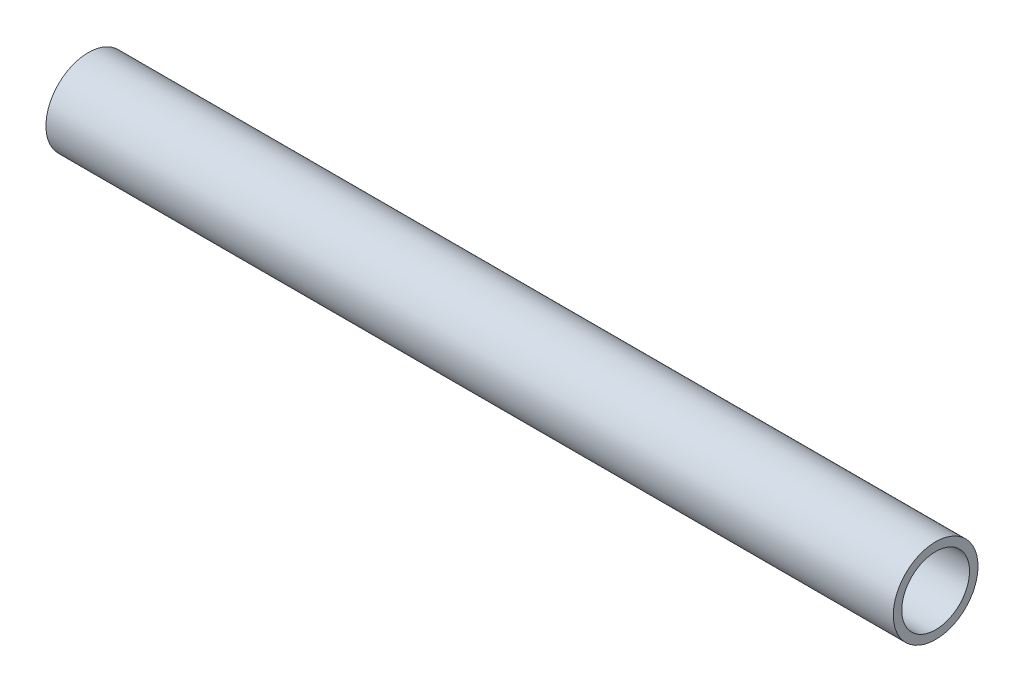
ISO-10303-21;
HEADER;
FILE_DESCRIPTION(('STEP AP214'),'2;1');
FILE_NAME('part.step','',(''),(''),'','','');
FILE_SCHEMA(('AUTOMOTIVE_DESIGN { 1 0 10303 214 1 1 1 1 }'));
ENDSEC;
DATA;
#1=APPLICATION_CONTEXT('core data for automotive mechanical design processes');
#2=APPLICATION_PROTOCOL_DEFINITION('international standard','automotive_design',2000,#1);
#3=PRODUCT_CONTEXT('',#1,'mechanical');
#4=PRODUCT('Part','Part','',(#3));
#5=PRODUCT_RELATED_PRODUCT_CATEGORY('part','',(#4));
#6=PRODUCT_DEFINITION_FORMATION('','',#4);
#7=PRODUCT_DEFINITION_CONTEXT('part definition',#1,'design');
#8=PRODUCT_DEFINITION('design','',#6,#7);
#9=PRODUCT_DEFINITION_SHAPE('','',#8);
#10=(LENGTH_UNIT() NAMED_UNIT(*) SI_UNIT(.MILLI.,.METRE.));
#11=(NAMED_UNIT(*) PLANE_ANGLE_UNIT() SI_UNIT($,.RADIAN.));
#12=(NAMED_UNIT(*) SI_UNIT($,.STERADIAN.) SOLID_ANGLE_UNIT());
#13=UNCERTAINTY_MEASURE_WITH_UNIT(LENGTH_MEASURE(1.E-05),#10,'distance_accuracy_value','');
#14=(GEOMETRIC_REPRESENTATION_CONTEXT(3) GLOBAL_UNCERTAINTY_ASSIGNED_CONTEXT((#13)) GLOBAL_UNIT_ASSIGNED_CONTEXT((#10,
#11,#12)) REPRESENTATION_CONTEXT('',''));
#15=CARTESIAN_POINT('',(0.,0.,0.));
#16=DIRECTION('',(0.,0.,1.));
#17=DIRECTION('',(1.,0.,0.));
#18=AXIS2_PLACEMENT_3D('',#15,#16,#17);
#19=CARTESIAN_POINT('',(250.,0.,0.));
#20=DIRECTION('',(1.,0.,0.));
#21=DIRECTION('',(0.,0.,-1.));
#22=AXIS2_PLACEMENT_3D('',#19,#20,#21);
#23=PLANE('',#22);
#24=CARTESIAN_POINT('',(250.,0.,0.));
#25=DIRECTION('',(1.,0.,0.));
#26=DIRECTION('',(0.,0.,-1.));
#27=AXIS2_PLACEMENT_3D('',#24,#25,#26);
#28=CIRCLE('',#27,12.5);
#29=CARTESIAN_POINT('',(250.,0.,-12.5));
#30=VERTEX_POINT('',#29);
#31=EDGE_CURVE('E10',#30,#30,#28,.T.);
#32=ORIENTED_EDGE('',*,*,#31,.T.);
#33=EDGE_LOOP('',(#32));
#34=FACE_BOUND('',#33,.T.);
#35=CARTESIAN_POINT('',(250.,0.,0.));
#36=DIRECTION('',(1.,0.,0.));
#37=DIRECTION('',(0.,0.,-1.));
#38=AXIS2_PLACEMENT_3D('',#35,#36,#37);
#39=CIRCLE('',#38,10.);
#40=CARTESIAN_POINT('',(250.,0.,-10.));
#41=VERTEX_POINT('',#40);
#42=EDGE_CURVE('E56',#41,#41,#39,.T.);
#43=ORIENTED_EDGE('',*,*,#42,.F.);
#44=EDGE_LOOP('',(#43));
#45=FACE_BOUND('',#44,.T.);
#46=ADVANCED_FACE('F45',(#34,#45),#23,.T.);
#47=CARTESIAN_POINT('',(0.,0.,0.));
#48=DIRECTION('',(1.,0.,0.));
#49=DIRECTION('',(0.,0.,-1.));
#50=AXIS2_PLACEMENT_3D('',#47,#48,#49);
#51=PLANE('',#50);
#52=CARTESIAN_POINT('',(0.,0.,0.));
#53=DIRECTION('',(1.,0.,0.));
#54=DIRECTION('',(0.,0.,-1.));
#55=AXIS2_PLACEMENT_3D('',#52,#53,#54);
#56=CIRCLE('',#55,12.5);
#57=CARTESIAN_POINT('',(0.,0.,-12.5));
#58=VERTEX_POINT('',#57);
#59=EDGE_CURVE('E49',#58,#58,#56,.T.);
#60=ORIENTED_EDGE('',*,*,#59,.F.);
#61=EDGE_LOOP('',(#60));
#62=FACE_BOUND('',#61,.T.);
#63=CARTESIAN_POINT('',(0.,0.,0.));
#64=DIRECTION('',(1.,0.,0.));
#65=DIRECTION('',(0.,0.,-1.));
#66=AXIS2_PLACEMENT_3D('',#63,#64,#65);
#67=CIRCLE('',#66,10.);
#68=CARTESIAN_POINT('',(0.,0.,-10.));
#69=VERTEX_POINT('',#68);
#70=EDGE_CURVE('E58',#69,#69,#67,.T.);
#71=ORIENTED_EDGE('',*,*,#70,.T.);
#72=EDGE_LOOP('',(#71));
#73=FACE_BOUND('',#72,.T.);
#74=ADVANCED_FACE('F68',(#62,#73),#51,.F.);
#75=CARTESIAN_POINT('',(250.,0.,0.));
#76=DIRECTION('',(-1.,0.,0.));
#77=DIRECTION('',(0.,0.,1.));
#78=AXIS2_PLACEMENT_3D('',#75,#76,#77);
#79=CYLINDRICAL_SURFACE('',#78,12.5);
#80=ORIENTED_EDGE('',*,*,#31,.F.);
#81=EDGE_LOOP('',(#80));
#82=FACE_BOUND('',#81,.T.);
#83=ORIENTED_EDGE('',*,*,#59,.T.);
#84=EDGE_LOOP('',(#83));
#85=FACE_BOUND('',#84,.T.);
#86=ADVANCED_FACE('F47',(#82,#85),#79,.T.);
#87=CARTESIAN_POINT('',(250.,0.,0.));
#88=DIRECTION('',(-1.,0.,0.));
#89=DIRECTION('',(0.,0.,1.));
#90=AXIS2_PLACEMENT_3D('',#87,#88,#89);
#91=CYLINDRICAL_SURFACE('',#90,10.);
#92=ORIENTED_EDGE('',*,*,#42,.T.);
#93=EDGE_LOOP('',(#92));
#94=FACE_BOUND('',#93,.T.);
#95=ORIENTED_EDGE('',*,*,#70,.F.);
#96=EDGE_LOOP('',(#95));
#97=FACE_BOUND('',#96,.T.);
#98=ADVANCED_FACE('F64',(#94,#97),#91,.F.);
#99=CLOSED_SHELL('',(#46,#74,#86,#98));
#100=MANIFOLD_SOLID_BREP('B2',#99);
#101=ADVANCED_BREP_SHAPE_REPRESENTATION('',(#18,#100),#14);
#102=SHAPE_DEFINITION_REPRESENTATION(#9,#101);
ENDSEC;
END-ISO-10303-21;
